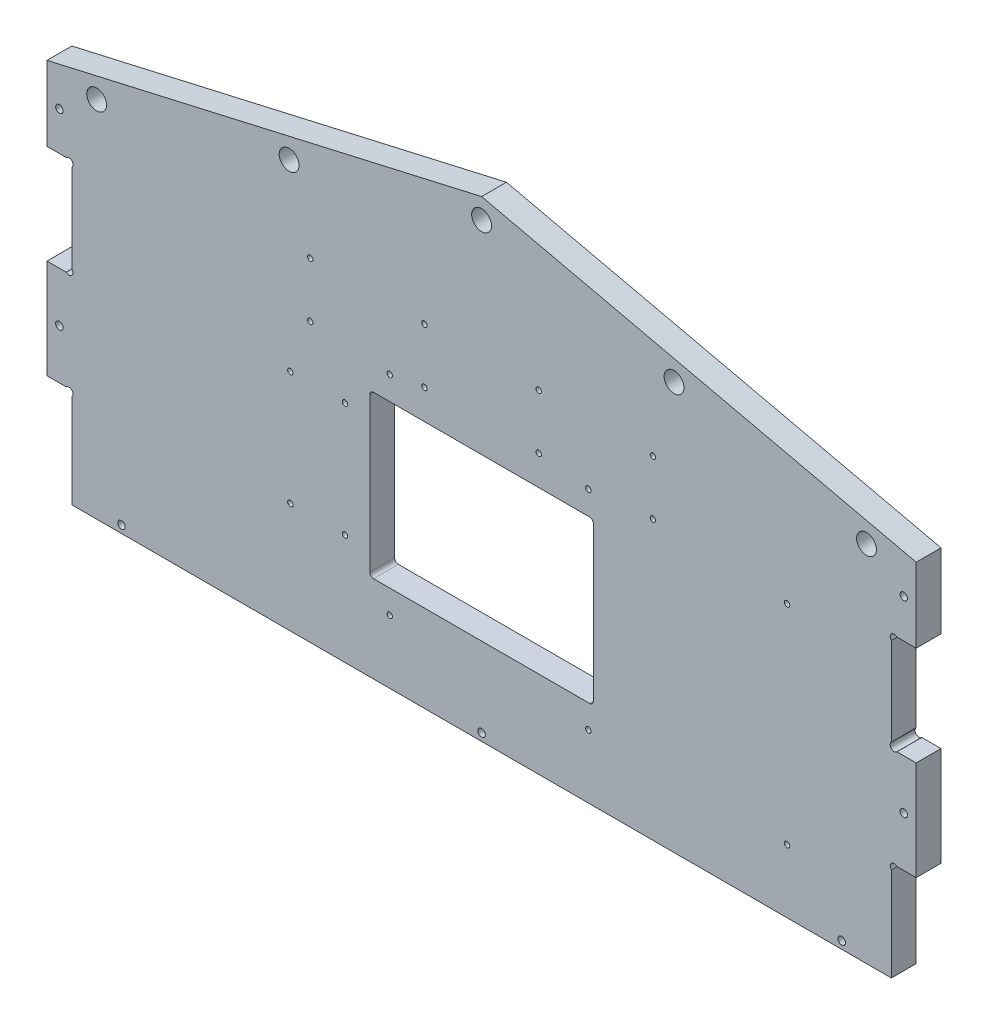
from build123d import *

# Parameters (mm, degrees)
EXTRUSION1_DEPTH                             = 10
ESQUISSE4_R                                  = 1.6
ENL_V_MAT_EXTRU_1_ENFOURCHEMENT_DEPTH        = 399.371685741
ESQUISSE5_R                                  = 1.5
ENL_V_MAT_EXTRU_2_FIXATION_SOL_ET_MURS_DEPTH = 399.371685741
ESQUISSE6_R                                  = 4
ENL_V_MAT_EXTRU_3_FIXATION_CABLES_DEPTH      = 399.371685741
ENL_V_MAT_EXTRU_4_FENETRE_DEPTH              = 399.371685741
ESQUISSE8_R                                  = 1.1
ENL_V_MAT_EXTRU_5_TRAME1_DEPTH               = 399.371685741
ESQUISSE10_R                                 = 1.1
ENL_V_MAT_EXTRU_6_FIXATION_GLISSIERE_DEPTH   = 399.371685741
ESQUISSE11_R                                 = 1.1
ENL_V_MAT_EXTRU_1_DEPTH                      = 399.371685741


with BuildPart() as part:
    # Esquisse1 → Extrusion1 (new body)
    with BuildSketch(Plane.XY):
        Polygon((0, 40), (10, 40), (10, 0), (340, 0), (340, 40), (350, 40), (350, 80), (340, 80), (340, 120), (350, 120), (350, 150), (175, 190), (0, 150), (0, 120), (10, 120), (10, 80), (0, 80), align=None)
    extrude(amount=EXTRUSION1_DEPTH)

    # Esquisse4 → Enl_v. mat.-Extru.1_enfourchement (cut, through all)
    with BuildSketch(Plane.XY.offset(10)):
        with Locations((8.86862915, 118.86862915)):
            Circle(ESQUISSE4_R)
        with Locations((8.86862915, 81.13137085)):
            Circle(ESQUISSE4_R)
        with Locations((8.86862915, 38.86862915)):
            Circle(ESQUISSE4_R)
        with Locations((341.13137085, 118.86862915)):
            Circle(ESQUISSE4_R)
        with Locations((341.13137085, 81.13137085)):
            Circle(ESQUISSE4_R)
        with Locations((341.13137085, 38.86862915)):
            Circle(ESQUISSE4_R)
    extrude(amount=-ENL_V_MAT_EXTRU_1_ENFOURCHEMENT_DEPTH, mode=Mode.SUBTRACT)

    # Esquisse5 → Enl_v. mat.-Extru.2_fixation sol et murs (cut, through all)
    with BuildSketch(Plane.XY.offset(10)):
        with Locations((30, 3)):
            Circle(ESQUISSE5_R)
        with Locations((175, 3)):
            Circle(ESQUISSE5_R)
        with Locations((320, 3)):
            Circle(ESQUISSE5_R)
        with Locations((5, 135.571428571)):
            Circle(ESQUISSE5_R)
        with Locations((345, 135.571428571)):
            Circle(ESQUISSE5_R)
        with Locations((5, 60)):
            Circle(ESQUISSE5_R)
        with Locations((345, 60)):
            Circle(ESQUISSE5_R)
    extrude(amount=-ENL_V_MAT_EXTRU_2_FIXATION_SOL_ET_MURS_DEPTH, mode=Mode.SUBTRACT)

    # Esquisse6 → Enl_v. mat.-Extru.3_fixation cables (cut, through all)
    with BuildSketch(Plane.XY.offset(10)):
        with Locations((175, 181.793680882)):
            Circle(ESQUISSE6_R)
        with Locations((330, 146.365109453)):
            Circle(ESQUISSE6_R)
        with Locations((20, 146.365109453)):
            Circle(ESQUISSE6_R)
        with Locations((252.501251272, 164.079109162)):
            Circle(ESQUISSE6_R)
        with Locations((97.498748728, 164.079109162)):
            Circle(ESQUISSE6_R)
    extrude(amount=-ENL_V_MAT_EXTRU_3_FIXATION_CABLES_DEPTH, mode=Mode.SUBTRACT)

    # Esquisse7 → Enl_v. mat.-Extru.4_fenetre (cut, through all)
    with BuildSketch(Plane.XY.offset(10)):
        with BuildLine():
            Line((131.5, 100), (218.5, 100))
            ThreePointArc((218.5, 100), (219.560660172, 99.560660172), (220, 98.5))
            Line((220, 98.5), (220, 36.5))
            ThreePointArc((220, 36.5), (219.560660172, 35.439339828), (218.5, 35))
            Line((218.5, 35), (131.5, 35))
            ThreePointArc((131.5, 35), (130.439339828, 35.439339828), (130, 36.5))
            Line((130, 36.5), (130, 98.5))
            ThreePointArc((130, 98.5), (130.439339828, 99.560660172), (131.5, 100))
        make_face()
    extrude(amount=-ENL_V_MAT_EXTRU_4_FENETRE_DEPTH, mode=Mode.SUBTRACT)

    # Esquisse8 → Enl_v. mat.-Extru.5_trame1 (cut, through all)
    with BuildSketch(Plane.XY.offset(10)):
        with Locations((198, 134)):
            Circle(ESQUISSE8_R)
        with Locations((198, 112)):
            Circle(ESQUISSE8_R)
        with Locations((152, 112)):
            Circle(ESQUISSE8_R)
        with Locations((152, 134)):
            Circle(ESQUISSE8_R)
        with Locations((106, 134)):
            Circle(ESQUISSE8_R)
        with Locations((106, 112)):
            Circle(ESQUISSE8_R)
        with Locations((244, 134)):
            Circle(ESQUISSE8_R)
        with Locations((244, 112)):
            Circle(ESQUISSE8_R)
    extrude(amount=-ENL_V_MAT_EXTRU_5_TRAME1_DEPTH, mode=Mode.SUBTRACT)

    # Esquisse10 → Enl_v. mat.-Extru.6_fixation glissiere (cut, through all)
    with BuildSketch(Plane.XY.offset(10)):
        with Locations((138, 109.5)):
            Circle(ESQUISSE10_R)
        with Locations((218, 109.5)):
            Circle(ESQUISSE10_R)
        with Locations((298, 109.5)):
            Circle(ESQUISSE10_R)
        with Locations((298, 25.5)):
            Circle(ESQUISSE10_R)
        with Locations((218, 25.5)):
            Circle(ESQUISSE10_R)
        with Locations((138, 25.5)):
            Circle(ESQUISSE10_R)
    extrude(amount=-ENL_V_MAT_EXTRU_6_FIXATION_GLISSIERE_DEPTH, mode=Mode.SUBTRACT)

    # Esquisse11 → Enl_v. mat.-Extru.1 (cut, through all)
    with BuildSketch(Plane(origin=(0, 0, 0), x_dir=(-1, 0, 0), z_dir=(0, 0, -1))):
        with Locations((-120, 90.5)):
            Circle(ESQUISSE11_R)
        with Locations((-98, 90.5)):
            Circle(ESQUISSE11_R)
        with Locations((-98, 44.5)):
            Circle(ESQUISSE11_R)
        with Locations((-120, 44.5)):
            Circle(ESQUISSE11_R)
    extrude(amount=-ENL_V_MAT_EXTRU_1_DEPTH, mode=Mode.SUBTRACT)


solid = part.part
